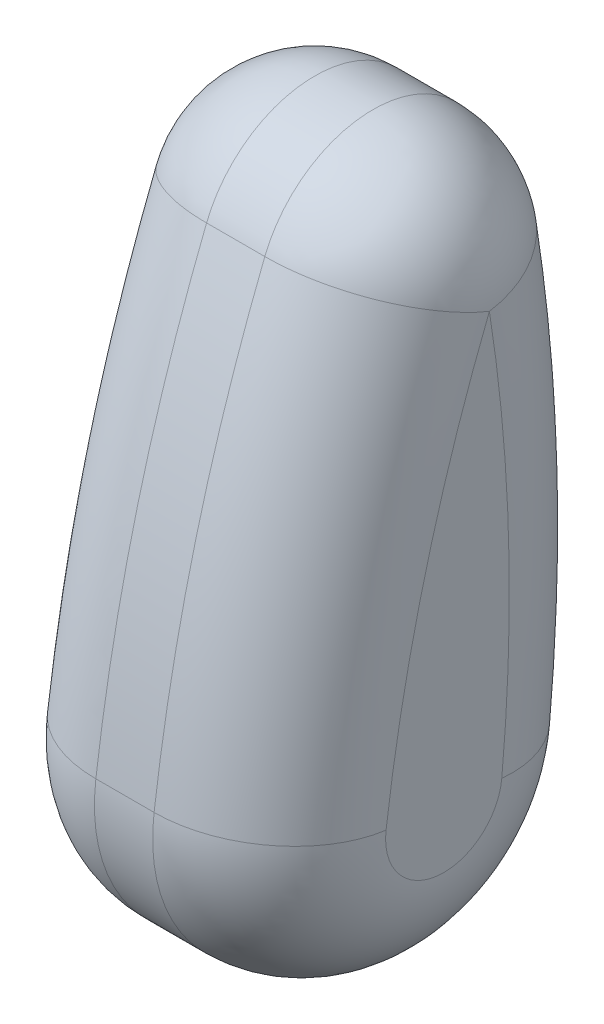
ISO-10303-21;
HEADER;
FILE_DESCRIPTION(('STEP AP214'),'2;1');
FILE_NAME('part.step','',(''),(''),'','','');
FILE_SCHEMA(('AUTOMOTIVE_DESIGN { 1 0 10303 214 1 1 1 1 }'));
ENDSEC;
DATA;
#1=APPLICATION_CONTEXT('core data for automotive mechanical design processes');
#2=APPLICATION_PROTOCOL_DEFINITION('international standard','automotive_design',2000,#1);
#3=PRODUCT_CONTEXT('',#1,'mechanical');
#4=PRODUCT('Part','Part','',(#3));
#5=PRODUCT_RELATED_PRODUCT_CATEGORY('part','',(#4));
#6=PRODUCT_DEFINITION_FORMATION('','',#4);
#7=PRODUCT_DEFINITION_CONTEXT('part definition',#1,'design');
#8=PRODUCT_DEFINITION('design','',#6,#7);
#9=PRODUCT_DEFINITION_SHAPE('','',#8);
#10=(LENGTH_UNIT() NAMED_UNIT(*) SI_UNIT(.MILLI.,.METRE.));
#11=(NAMED_UNIT(*) PLANE_ANGLE_UNIT() SI_UNIT($,.RADIAN.));
#12=(NAMED_UNIT(*) SI_UNIT($,.STERADIAN.) SOLID_ANGLE_UNIT());
#13=UNCERTAINTY_MEASURE_WITH_UNIT(LENGTH_MEASURE(1.E-05),#10,'distance_accuracy_value','');
#14=(GEOMETRIC_REPRESENTATION_CONTEXT(3) GLOBAL_UNCERTAINTY_ASSIGNED_CONTEXT((#13)) GLOBAL_UNIT_ASSIGNED_CONTEXT((#10,
#11,#12)) REPRESENTATION_CONTEXT('',''));
#15=CARTESIAN_POINT('',(0.,0.,0.));
#16=DIRECTION('',(0.,0.,1.));
#17=DIRECTION('',(1.,0.,0.));
#18=AXIS2_PLACEMENT_3D('',#15,#16,#17);
#19=CARTESIAN_POINT('',(63.5,105.260529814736,-686.134802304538));
#20=DIRECTION('',(-1.,0.,0.));
#21=DIRECTION('',(0.,0.,1.));
#22=AXIS2_PLACEMENT_3D('',#19,#20,#21);
#23=CYLINDRICAL_SURFACE('',#22,762.);
#24=DIRECTION('',(-1.,0.,0.));
#25=VECTOR('',#24,1.);
#26=CARTESIAN_POINT('',(63.5,388.315122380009,21.3424748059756));
#27=LINE('',#26,#25);
#28=CARTESIAN_POINT('',(12.7,388.315122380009,21.3424748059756));
#29=VERTEX_POINT('',#28);
#30=CARTESIAN_POINT('',(-12.7,388.315122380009,21.3424748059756));
#31=VERTEX_POINT('',#30);
#32=EDGE_CURVE('E141',#29,#31,#27,.T.);
#33=ORIENTED_EDGE('',*,*,#32,.T.);
#34=CARTESIAN_POINT('',(-12.7,105.260529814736,-686.134802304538));
#35=DIRECTION('',(-1.,0.,0.));
#36=DIRECTION('',(0.,0.,1.));
#37=AXIS2_PLACEMENT_3D('',#34,#35,#36);
#38=CIRCLE('',#37,762.);
#39=CARTESIAN_POINT('',(-12.7,202.482225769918,69.6376117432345));
#40=VERTEX_POINT('',#39);
#41=EDGE_CURVE('E133',#40,#31,#38,.T.);
#42=ORIENTED_EDGE('',*,*,#41,.F.);
#43=DIRECTION('',(-1.,0.,0.));
#44=VECTOR('',#43,1.);
#45=CARTESIAN_POINT('',(63.5,202.482225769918,69.6376117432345));
#46=LINE('',#45,#44);
#47=CARTESIAN_POINT('',(12.7,202.482225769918,69.6376117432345));
#48=VERTEX_POINT('',#47);
#49=EDGE_CURVE('E147',#48,#40,#46,.T.);
#50=ORIENTED_EDGE('',*,*,#49,.F.);
#51=CARTESIAN_POINT('',(12.7,105.260529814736,-686.134802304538));
#52=DIRECTION('',(-1.,0.,0.));
#53=DIRECTION('',(0.,0.,1.));
#54=AXIS2_PLACEMENT_3D('',#51,#52,#53);
#55=CIRCLE('',#54,762.);
#56=EDGE_CURVE('E46',#48,#29,#55,.T.);
#57=ORIENTED_EDGE('',*,*,#56,.T.);
#58=EDGE_LOOP('',(#33,#42,#50,#57));
#59=FACE_BOUND('',#58,.T.);
#60=ADVANCED_FACE('F37',(#59),#23,.T.);
#61=CARTESIAN_POINT('',(63.5,192.760056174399,-5.93962966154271));
#62=DIRECTION('',(-1.,0.,0.));
#63=DIRECTION('',(0.,0.,1.));
#64=AXIS2_PLACEMENT_3D('',#61,#62,#63);
#65=CYLINDRICAL_SURFACE('',#64,76.2);
#66=ORIENTED_EDGE('',*,*,#49,.T.);
#67=CARTESIAN_POINT('',(-12.7,192.760056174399,-5.93962966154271));
#68=DIRECTION('',(-1.,0.,0.));
#69=DIRECTION('',(0.,0.,1.));
#70=AXIS2_PLACEMENT_3D('',#67,#68,#69);
#71=CIRCLE('',#70,76.2);
#72=CARTESIAN_POINT('',(-12.7,185.441760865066,-81.7873887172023));
#73=VERTEX_POINT('',#72);
#74=EDGE_CURVE('E118',#73,#40,#71,.T.);
#75=ORIENTED_EDGE('',*,*,#74,.F.);
#76=DIRECTION('',(-1.,0.,0.));
#77=VECTOR('',#76,1.);
#78=CARTESIAN_POINT('',(63.5,185.441760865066,-81.7873887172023));
#79=LINE('',#78,#77);
#80=CARTESIAN_POINT('',(12.7,185.441760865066,-81.7873887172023));
#81=VERTEX_POINT('',#80);
#82=EDGE_CURVE('E145',#81,#73,#79,.T.);
#83=ORIENTED_EDGE('',*,*,#82,.F.);
#84=CARTESIAN_POINT('',(12.7,192.760056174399,-5.93962966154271));
#85=DIRECTION('',(-1.,0.,0.));
#86=DIRECTION('',(0.,0.,1.));
#87=AXIS2_PLACEMENT_3D('',#84,#85,#86);
#88=CIRCLE('',#87,76.2);
#89=EDGE_CURVE('E156',#81,#48,#88,.T.);
#90=ORIENTED_EDGE('',*,*,#89,.T.);
#91=EDGE_LOOP('',(#66,#75,#83,#90));
#92=FACE_BOUND('',#91,.T.);
#93=ADVANCED_FACE('F183',(#92),#65,.T.);
#94=CARTESIAN_POINT('',(63.5,258.624713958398,676.690201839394));
#95=DIRECTION('',(-1.,0.,0.));
#96=DIRECTION('',(0.,0.,1.));
#97=AXIS2_PLACEMENT_3D('',#94,#95,#96);
#98=CYLINDRICAL_SURFACE('',#97,762.);
#99=ORIENTED_EDGE('',*,*,#82,.T.);
#100=CARTESIAN_POINT('',(-12.7,258.624713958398,676.690201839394));
#101=DIRECTION('',(-1.,0.,0.));
#102=DIRECTION('',(0.,0.,1.));
#103=AXIS2_PLACEMENT_3D('',#100,#101,#102);
#104=CIRCLE('',#103,762.);
#105=CARTESIAN_POINT('',(-12.7,377.36053779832,-76.0021683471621));
#106=VERTEX_POINT('',#105);
#107=EDGE_CURVE('E106',#106,#73,#104,.T.);
#108=ORIENTED_EDGE('',*,*,#107,.F.);
#109=DIRECTION('',(-1.,0.,0.));
#110=VECTOR('',#109,1.);
#111=CARTESIAN_POINT('',(63.5,377.36053779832,-76.0021683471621));
#112=LINE('',#111,#110);
#113=CARTESIAN_POINT('',(12.7,377.36053779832,-76.0021683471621));
#114=VERTEX_POINT('',#113);
#115=EDGE_CURVE('E143',#114,#106,#112,.T.);
#116=ORIENTED_EDGE('',*,*,#115,.F.);
#117=CARTESIAN_POINT('',(12.7,258.624713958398,676.690201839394));
#118=DIRECTION('',(-1.,0.,0.));
#119=DIRECTION('',(0.,0.,1.));
#120=AXIS2_PLACEMENT_3D('',#117,#118,#119);
#121=CIRCLE('',#120,762.);
#122=EDGE_CURVE('E11',#114,#81,#121,.T.);
#123=ORIENTED_EDGE('',*,*,#122,.T.);
#124=EDGE_LOOP('',(#99,#108,#116,#123));
#125=FACE_BOUND('',#124,.T.);
#126=ADVANCED_FACE('F180',(#125),#98,.T.);
#127=CARTESIAN_POINT('',(63.5,369.444816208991,-25.8226770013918));
#128=DIRECTION('',(-1.,0.,0.));
#129=DIRECTION('',(0.,0.,1.));
#130=AXIS2_PLACEMENT_3D('',#127,#128,#129);
#131=CYLINDRICAL_SURFACE('',#130,50.7999999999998);
#132=ORIENTED_EDGE('',*,*,#115,.T.);
#133=CARTESIAN_POINT('',(-12.7,369.444816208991,-25.8226770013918));
#134=DIRECTION('',(-1.,0.,0.));
#135=DIRECTION('',(0.,0.,1.));
#136=AXIS2_PLACEMENT_3D('',#133,#134,#135);
#137=CIRCLE('',#136,50.7999999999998);
#138=EDGE_CURVE('E130',#31,#106,#137,.T.);
#139=ORIENTED_EDGE('',*,*,#138,.F.);
#140=ORIENTED_EDGE('',*,*,#32,.F.);
#141=CARTESIAN_POINT('',(12.7,369.444816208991,-25.8226770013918));
#142=DIRECTION('',(-1.,0.,0.));
#143=DIRECTION('',(0.,0.,1.));
#144=AXIS2_PLACEMENT_3D('',#141,#142,#143);
#145=CIRCLE('',#144,50.7999999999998);
#146=EDGE_CURVE('E54',#29,#114,#145,.T.);
#147=ORIENTED_EDGE('',*,*,#146,.T.);
#148=EDGE_LOOP('',(#132,#139,#140,#147));
#149=FACE_BOUND('',#148,.T.);
#150=ADVANCED_FACE('F190',(#149),#131,.T.);
#151=CARTESIAN_POINT('',(63.5,237.352673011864,-355.978739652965));
#152=DIRECTION('',(-1.,0.,0.));
#153=DIRECTION('',(0.,0.,1.));
#154=AXIS2_PLACEMENT_3D('',#151,#152,#153);
#155=PLANE('',#154);
#156=CARTESIAN_POINT('',(63.5,105.260529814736,-686.134802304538));
#157=DIRECTION('',(-1.,0.,0.));
#158=DIRECTION('',(0.,0.,1.));
#159=AXIS2_PLACEMENT_3D('',#156,#157,#158);
#160=CIRCLE('',#159,711.2);
#161=CARTESIAN_POINT('',(63.5,369.444816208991,-25.8226770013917));
#162=VERTEX_POINT('',#161);
#163=CARTESIAN_POINT('',(63.5,196.000779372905,19.2527841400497));
#164=VERTEX_POINT('',#163);
#165=EDGE_CURVE('E151',#162,#164,#160,.F.);
#166=ORIENTED_EDGE('',*,*,#165,.T.);
#167=CARTESIAN_POINT('',(63.5,192.760056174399,-5.93962966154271));
#168=DIRECTION('',(-1.,0.,0.));
#169=DIRECTION('',(0.,0.,1.));
#170=AXIS2_PLACEMENT_3D('',#167,#168,#169);
#171=CIRCLE('',#170,25.4);
#172=CARTESIAN_POINT('',(63.5,190.320624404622,-31.2222160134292));
#173=VERTEX_POINT('',#172);
#174=EDGE_CURVE('E153',#164,#173,#171,.F.);
#175=ORIENTED_EDGE('',*,*,#174,.T.);
#176=CARTESIAN_POINT('',(63.5,258.624713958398,676.690201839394));
#177=DIRECTION('',(-1.,0.,0.));
#178=DIRECTION('',(0.,0.,1.));
#179=AXIS2_PLACEMENT_3D('',#176,#177,#178);
#180=CIRCLE('',#179,711.2);
#181=EDGE_CURVE('E149',#173,#162,#180,.F.);
#182=ORIENTED_EDGE('',*,*,#181,.T.);
#183=EDGE_LOOP('',(#166,#175,#182));
#184=FACE_BOUND('',#183,.T.);
#185=ADVANCED_FACE('F188',(#184),#155,.F.);
#186=CARTESIAN_POINT('',(12.7,369.444816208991,-25.8226770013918));
#187=DIRECTION('',(0.,0.,1.));
#188=DIRECTION('',(1.,0.,0.));
#189=AXIS2_PLACEMENT_3D('',#186,#187,#188);
#190=SPHERICAL_SURFACE('',#189,50.8);
#191=CARTESIAN_POINT('',(12.7,369.444816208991,-25.8226770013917));
#192=DIRECTION('',(0.,-0.987785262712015,-0.155821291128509));
#193=DIRECTION('',(0.,0.155821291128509,-0.987785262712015));
#194=AXIS2_PLACEMENT_3D('',#191,#192,#193);
#195=CIRCLE('',#194,50.8);
#196=EDGE_CURVE('E163',#114,#162,#195,.T.);
#197=ORIENTED_EDGE('',*,*,#196,.F.);
#198=ORIENTED_EDGE('',*,*,#146,.F.);
#199=CARTESIAN_POINT('',(12.7,369.444816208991,-25.8226770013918));
#200=DIRECTION('',(0.,-0.928447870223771,0.371462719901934));
#201=DIRECTION('',(0.,-0.371462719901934,-0.928447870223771));
#202=AXIS2_PLACEMENT_3D('',#199,#200,#201);
#203=CIRCLE('',#202,50.8);
#204=EDGE_CURVE('E41',#162,#29,#203,.T.);
#205=ORIENTED_EDGE('',*,*,#204,.F.);
#206=EDGE_LOOP('',(#197,#198,#205));
#207=FACE_BOUND('',#206,.T.);
#208=ADVANCED_FACE('F39',(#207),#190,.T.);
#209=CARTESIAN_POINT('',(12.7,105.260529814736,-686.134802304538));
#210=DIRECTION('',(-1.,0.,0.));
#211=DIRECTION('',(0.,0.,1.));
#212=AXIS2_PLACEMENT_3D('',#209,#210,#211);
#213=TOROIDAL_SURFACE('',#212,711.2,50.8);
#214=ORIENTED_EDGE('',*,*,#204,.T.);
#215=ORIENTED_EDGE('',*,*,#56,.F.);
#216=CARTESIAN_POINT('',(12.7,196.000779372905,19.2527841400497));
#217=DIRECTION('',(0.,-0.991827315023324,0.127587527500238));
#218=DIRECTION('',(0.,-0.127587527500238,-0.991827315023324));
#219=AXIS2_PLACEMENT_3D('',#216,#217,#218);
#220=CIRCLE('',#219,50.8);
#221=EDGE_CURVE('E162',#164,#48,#220,.T.);
#222=ORIENTED_EDGE('',*,*,#221,.F.);
#223=ORIENTED_EDGE('',*,*,#165,.F.);
#224=EDGE_LOOP('',(#214,#215,#222,#223));
#225=FACE_BOUND('',#224,.T.);
#226=ADVANCED_FACE('F173',(#225),#213,.T.);
#227=CARTESIAN_POINT('',(12.7,258.624713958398,676.690201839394));
#228=DIRECTION('',(-1.,0.,0.));
#229=DIRECTION('',(0.,0.,1.));
#230=AXIS2_PLACEMENT_3D('',#227,#228,#229);
#231=TOROIDAL_SURFACE('',#230,711.2,50.8);
#232=ORIENTED_EDGE('',*,*,#196,.T.);
#233=ORIENTED_EDGE('',*,*,#181,.F.);
#234=CARTESIAN_POINT('',(12.7,190.320624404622,-31.2222160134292));
#235=DIRECTION('',(0.,-0.995377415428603,0.0960406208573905));
#236=DIRECTION('',(0.,-0.0960406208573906,-0.995377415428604));
#237=AXIS2_PLACEMENT_3D('',#234,#235,#236);
#238=CIRCLE('',#237,50.8);
#239=EDGE_CURVE('E136',#81,#173,#238,.T.);
#240=ORIENTED_EDGE('',*,*,#239,.F.);
#241=ORIENTED_EDGE('',*,*,#122,.F.);
#242=EDGE_LOOP('',(#232,#233,#240,#241));
#243=FACE_BOUND('',#242,.T.);
#244=ADVANCED_FACE('F177',(#243),#231,.T.);
#245=CARTESIAN_POINT('',(12.7,192.760056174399,-5.93962966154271));
#246=DIRECTION('',(-1.,0.,0.));
#247=DIRECTION('',(0.,0.,1.));
#248=AXIS2_PLACEMENT_3D('',#245,#246,#247);
#249=DEGENERATE_TOROIDAL_SURFACE('',#248,25.4,50.8,.T.);
#250=ORIENTED_EDGE('',*,*,#221,.T.);
#251=ORIENTED_EDGE('',*,*,#89,.F.);
#252=ORIENTED_EDGE('',*,*,#239,.T.);
#253=ORIENTED_EDGE('',*,*,#174,.F.);
#254=EDGE_LOOP('',(#250,#251,#252,#253));
#255=FACE_BOUND('',#254,.T.);
#256=ADVANCED_FACE('F185',(#255),#249,.T.);
#257=CARTESIAN_POINT('',(-63.5,237.352673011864,-355.978739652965));
#258=DIRECTION('',(1.,0.,0.));
#259=DIRECTION('',(0.,0.,1.));
#260=AXIS2_PLACEMENT_3D('',#257,#258,#259);
#261=PLANE('',#260);
#262=CARTESIAN_POINT('',(-63.5,105.260529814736,-686.134802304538));
#263=DIRECTION('',(-1.,0.,0.));
#264=DIRECTION('',(0.,0.,1.));
#265=AXIS2_PLACEMENT_3D('',#262,#263,#264);
#266=CIRCLE('',#265,711.2);
#267=CARTESIAN_POINT('',(-63.5,369.444816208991,-25.8226770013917));
#268=VERTEX_POINT('',#267);
#269=CARTESIAN_POINT('',(-63.5,196.000779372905,19.2527841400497));
#270=VERTEX_POINT('',#269);
#271=EDGE_CURVE('E119',#268,#270,#266,.F.);
#272=ORIENTED_EDGE('',*,*,#271,.F.);
#273=CARTESIAN_POINT('',(-63.5,258.624713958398,676.690201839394));
#274=DIRECTION('',(-1.,0.,0.));
#275=DIRECTION('',(0.,0.,1.));
#276=AXIS2_PLACEMENT_3D('',#273,#274,#275);
#277=CIRCLE('',#276,711.2);
#278=CARTESIAN_POINT('',(-63.5,190.320624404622,-31.2222160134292));
#279=VERTEX_POINT('',#278);
#280=EDGE_CURVE('E103',#279,#268,#277,.F.);
#281=ORIENTED_EDGE('',*,*,#280,.F.);
#282=CARTESIAN_POINT('',(-63.5,192.760056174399,-5.93962966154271));
#283=DIRECTION('',(-1.,0.,0.));
#284=DIRECTION('',(0.,0.,1.));
#285=AXIS2_PLACEMENT_3D('',#282,#283,#284);
#286=CIRCLE('',#285,25.4);
#287=EDGE_CURVE('E113',#270,#279,#286,.F.);
#288=ORIENTED_EDGE('',*,*,#287,.F.);
#289=EDGE_LOOP('',(#272,#281,#288));
#290=FACE_BOUND('',#289,.T.);
#291=ADVANCED_FACE('F121',(#290),#261,.F.);
#292=CARTESIAN_POINT('',(-12.7,369.444816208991,-25.8226770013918));
#293=DIRECTION('',(0.,0.,1.));
#294=DIRECTION('',(-1.,0.,0.));
#295=AXIS2_PLACEMENT_3D('',#292,#293,#294);
#296=SPHERICAL_SURFACE('',#295,50.8);
#297=CARTESIAN_POINT('',(-12.7,369.444816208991,-25.8226770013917));
#298=DIRECTION('',(0.,0.987785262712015,0.155821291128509));
#299=DIRECTION('',(0.,0.155821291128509,-0.987785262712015));
#300=AXIS2_PLACEMENT_3D('',#297,#298,#299);
#301=CIRCLE('',#300,50.8);
#302=EDGE_CURVE('E126',#106,#268,#301,.T.);
#303=ORIENTED_EDGE('',*,*,#302,.T.);
#304=CARTESIAN_POINT('',(-12.7,369.444816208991,-25.8226770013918));
#305=DIRECTION('',(0.,0.928447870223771,-0.371462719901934));
#306=DIRECTION('',(0.,-0.371462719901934,-0.928447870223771));
#307=AXIS2_PLACEMENT_3D('',#304,#305,#306);
#308=CIRCLE('',#307,50.8);
#309=EDGE_CURVE('E122',#268,#31,#308,.T.);
#310=ORIENTED_EDGE('',*,*,#309,.T.);
#311=ORIENTED_EDGE('',*,*,#138,.T.);
#312=EDGE_LOOP('',(#303,#310,#311));
#313=FACE_BOUND('',#312,.T.);
#314=ADVANCED_FACE('F231',(#313),#296,.T.);
#315=CARTESIAN_POINT('',(-12.7,105.260529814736,-686.134802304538));
#316=DIRECTION('',(1.,0.,0.));
#317=DIRECTION('',(0.,0.,1.));
#318=AXIS2_PLACEMENT_3D('',#315,#316,#317);
#319=TOROIDAL_SURFACE('',#318,711.2,50.8);
#320=ORIENTED_EDGE('',*,*,#309,.F.);
#321=ORIENTED_EDGE('',*,*,#271,.T.);
#322=CARTESIAN_POINT('',(-12.7,196.000779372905,19.2527841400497));
#323=DIRECTION('',(0.,0.991827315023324,-0.127587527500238));
#324=DIRECTION('',(0.,-0.127587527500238,-0.991827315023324));
#325=AXIS2_PLACEMENT_3D('',#322,#323,#324);
#326=CIRCLE('',#325,50.8);
#327=EDGE_CURVE('E110',#270,#40,#326,.T.);
#328=ORIENTED_EDGE('',*,*,#327,.T.);
#329=ORIENTED_EDGE('',*,*,#41,.T.);
#330=EDGE_LOOP('',(#320,#321,#328,#329));
#331=FACE_BOUND('',#330,.T.);
#332=ADVANCED_FACE('F239',(#331),#319,.T.);
#333=CARTESIAN_POINT('',(-12.7,258.624713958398,676.690201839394));
#334=DIRECTION('',(1.,0.,0.));
#335=DIRECTION('',(0.,0.,1.));
#336=AXIS2_PLACEMENT_3D('',#333,#334,#335);
#337=TOROIDAL_SURFACE('',#336,711.2,50.8);
#338=ORIENTED_EDGE('',*,*,#302,.F.);
#339=ORIENTED_EDGE('',*,*,#107,.T.);
#340=CARTESIAN_POINT('',(-12.7,190.320624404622,-31.2222160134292));
#341=DIRECTION('',(0.,0.995377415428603,-0.0960406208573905));
#342=DIRECTION('',(0.,-0.0960406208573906,-0.995377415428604));
#343=AXIS2_PLACEMENT_3D('',#340,#341,#342);
#344=CIRCLE('',#343,50.8);
#345=EDGE_CURVE('E98',#73,#279,#344,.T.);
#346=ORIENTED_EDGE('',*,*,#345,.T.);
#347=ORIENTED_EDGE('',*,*,#280,.T.);
#348=EDGE_LOOP('',(#338,#339,#346,#347));
#349=FACE_BOUND('',#348,.T.);
#350=ADVANCED_FACE('F101',(#349),#337,.T.);
#351=CARTESIAN_POINT('',(-12.7,192.760056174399,-5.93962966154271));
#352=DIRECTION('',(1.,0.,0.));
#353=DIRECTION('',(0.,0.,1.));
#354=AXIS2_PLACEMENT_3D('',#351,#352,#353);
#355=DEGENERATE_TOROIDAL_SURFACE('',#354,25.4,50.8,.T.);
#356=ORIENTED_EDGE('',*,*,#327,.F.);
#357=ORIENTED_EDGE('',*,*,#287,.T.);
#358=ORIENTED_EDGE('',*,*,#345,.F.);
#359=ORIENTED_EDGE('',*,*,#74,.T.);
#360=EDGE_LOOP('',(#356,#357,#358,#359));
#361=FACE_BOUND('',#360,.T.);
#362=ADVANCED_FACE('F114',(#361),#355,.T.);
#363=CLOSED_SHELL('',(#60,#93,#126,#150,#185,#208,#226,#244,#256,#291,#314,#332,#350,#362));
#364=MANIFOLD_SOLID_BREP('B2',#363);
#365=ADVANCED_BREP_SHAPE_REPRESENTATION('',(#18,#364),#14);
#366=SHAPE_DEFINITION_REPRESENTATION(#9,#365);
ENDSEC;
END-ISO-10303-21;
